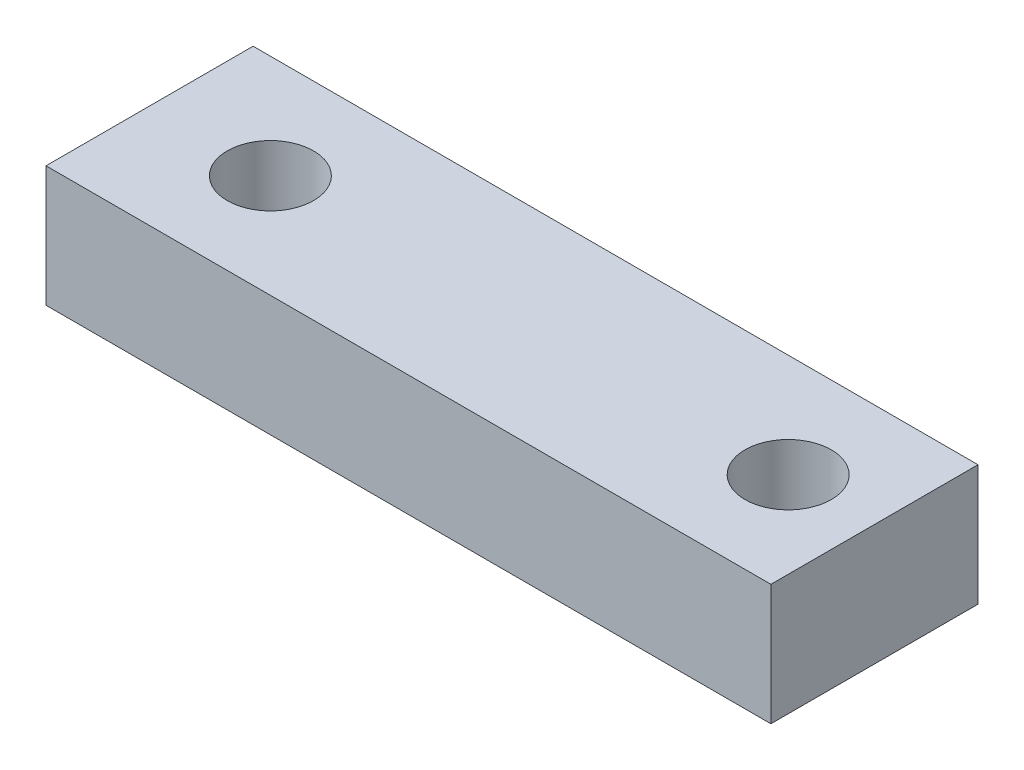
ISO-10303-21;
HEADER;
FILE_DESCRIPTION(('STEP AP214'),'2;1');
FILE_NAME('part.step','',(''),(''),'','','');
FILE_SCHEMA(('AUTOMOTIVE_DESIGN { 1 0 10303 214 1 1 1 1 }'));
ENDSEC;
DATA;
#1=APPLICATION_CONTEXT('core data for automotive mechanical design processes');
#2=APPLICATION_PROTOCOL_DEFINITION('international standard','automotive_design',2000,#1);
#3=PRODUCT_CONTEXT('',#1,'mechanical');
#4=PRODUCT('Part','Part','',(#3));
#5=PRODUCT_RELATED_PRODUCT_CATEGORY('part','',(#4));
#6=PRODUCT_DEFINITION_FORMATION('','',#4);
#7=PRODUCT_DEFINITION_CONTEXT('part definition',#1,'design');
#8=PRODUCT_DEFINITION('design','',#6,#7);
#9=PRODUCT_DEFINITION_SHAPE('','',#8);
#10=(LENGTH_UNIT() NAMED_UNIT(*) SI_UNIT(.MILLI.,.METRE.));
#11=(NAMED_UNIT(*) PLANE_ANGLE_UNIT() SI_UNIT($,.RADIAN.));
#12=(NAMED_UNIT(*) SI_UNIT($,.STERADIAN.) SOLID_ANGLE_UNIT());
#13=UNCERTAINTY_MEASURE_WITH_UNIT(LENGTH_MEASURE(1.E-05),#10,'distance_accuracy_value','');
#14=(GEOMETRIC_REPRESENTATION_CONTEXT(3) GLOBAL_UNCERTAINTY_ASSIGNED_CONTEXT((#13)) GLOBAL_UNIT_ASSIGNED_CONTEXT((#10,
#11,#12)) REPRESENTATION_CONTEXT('',''));
#15=CARTESIAN_POINT('',(0.,0.,0.));
#16=DIRECTION('',(0.,0.,1.));
#17=DIRECTION('',(1.,0.,0.));
#18=AXIS2_PLACEMENT_3D('',#15,#16,#17);
#19=CARTESIAN_POINT('',(0.,7.,-12.));
#20=DIRECTION('',(0.,-1.,0.));
#21=DIRECTION('',(0.,0.,-1.));
#22=AXIS2_PLACEMENT_3D('',#19,#20,#21);
#23=PLANE('',#22);
#24=CARTESIAN_POINT('',(37.,7.,-6.));
#25=DIRECTION('',(0.,1.,0.));
#26=DIRECTION('',(0.,0.,1.));
#27=AXIS2_PLACEMENT_3D('',#24,#25,#26);
#28=CIRCLE('',#27,2.5);
#29=CARTESIAN_POINT('',(37.,7.,-3.5));
#30=VERTEX_POINT('',#29);
#31=EDGE_CURVE('E85',#30,#30,#28,.T.);
#32=ORIENTED_EDGE('',*,*,#31,.F.);
#33=EDGE_LOOP('',(#32));
#34=FACE_BOUND('',#33,.T.);
#35=DIRECTION('',(0.,0.,1.));
#36=VECTOR('',#35,1.);
#37=CARTESIAN_POINT('',(0.,7.,0.));
#38=LINE('',#37,#36);
#39=CARTESIAN_POINT('',(0.,7.,-12.));
#40=VERTEX_POINT('',#39);
#41=CARTESIAN_POINT('',(0.,7.,0.));
#42=VERTEX_POINT('',#41);
#43=EDGE_CURVE('E95',#40,#42,#38,.T.);
#44=ORIENTED_EDGE('',*,*,#43,.T.);
#45=DIRECTION('',(1.,0.,0.));
#46=VECTOR('',#45,1.);
#47=CARTESIAN_POINT('',(0.,7.,0.));
#48=LINE('',#47,#46);
#49=CARTESIAN_POINT('',(42.,7.,0.));
#50=VERTEX_POINT('',#49);
#51=EDGE_CURVE('E80',#42,#50,#48,.T.);
#52=ORIENTED_EDGE('',*,*,#51,.T.);
#53=DIRECTION('',(0.,0.,-1.));
#54=VECTOR('',#53,1.);
#55=CARTESIAN_POINT('',(42.,7.,0.));
#56=LINE('',#55,#54);
#57=CARTESIAN_POINT('',(42.,7.,-12.));
#58=VERTEX_POINT('',#57);
#59=EDGE_CURVE('E46',#50,#58,#56,.T.);
#60=ORIENTED_EDGE('',*,*,#59,.T.);
#61=DIRECTION('',(-1.,0.,0.));
#62=VECTOR('',#61,1.);
#63=CARTESIAN_POINT('',(0.,7.,-12.));
#64=LINE('',#63,#62);
#65=EDGE_CURVE('E41',#58,#40,#64,.T.);
#66=ORIENTED_EDGE('',*,*,#65,.T.);
#67=EDGE_LOOP('',(#44,#52,#60,#66));
#68=FACE_BOUND('',#67,.T.);
#69=CARTESIAN_POINT('',(7.00000000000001,7.,-6.));
#70=DIRECTION('',(0.,1.,0.));
#71=DIRECTION('',(0.,0.,1.));
#72=AXIS2_PLACEMENT_3D('',#69,#70,#71);
#73=CIRCLE('',#72,2.5);
#74=CARTESIAN_POINT('',(7.00000000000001,7.,-3.5));
#75=VERTEX_POINT('',#74);
#76=EDGE_CURVE('E113',#75,#75,#73,.T.);
#77=ORIENTED_EDGE('',*,*,#76,.F.);
#78=EDGE_LOOP('',(#77));
#79=FACE_BOUND('',#78,.T.);
#80=ADVANCED_FACE('F26',(#34,#68,#79),#23,.F.);
#81=CARTESIAN_POINT('',(0.,0.,-12.));
#82=DIRECTION('',(0.,-1.,0.));
#83=DIRECTION('',(0.,0.,-1.));
#84=AXIS2_PLACEMENT_3D('',#81,#82,#83);
#85=PLANE('',#84);
#86=CARTESIAN_POINT('',(37.,0.,-6.));
#87=DIRECTION('',(0.,1.,0.));
#88=DIRECTION('',(0.,0.,1.));
#89=AXIS2_PLACEMENT_3D('',#86,#87,#88);
#90=CIRCLE('',#89,2.5);
#91=CARTESIAN_POINT('',(37.,0.,-3.5));
#92=VERTEX_POINT('',#91);
#93=EDGE_CURVE('E88',#92,#92,#90,.T.);
#94=ORIENTED_EDGE('',*,*,#93,.T.);
#95=EDGE_LOOP('',(#94));
#96=FACE_BOUND('',#95,.T.);
#97=DIRECTION('',(0.,0.,1.));
#98=VECTOR('',#97,1.);
#99=CARTESIAN_POINT('',(0.,0.,0.));
#100=LINE('',#99,#98);
#101=CARTESIAN_POINT('',(0.,0.,-12.));
#102=VERTEX_POINT('',#101);
#103=CARTESIAN_POINT('',(0.,0.,0.));
#104=VERTEX_POINT('',#103);
#105=EDGE_CURVE('E72',#102,#104,#100,.T.);
#106=ORIENTED_EDGE('',*,*,#105,.F.);
#107=DIRECTION('',(-1.,0.,0.));
#108=VECTOR('',#107,1.);
#109=CARTESIAN_POINT('',(0.,0.,-12.));
#110=LINE('',#109,#108);
#111=CARTESIAN_POINT('',(42.,0.,-12.));
#112=VERTEX_POINT('',#111);
#113=EDGE_CURVE('E93',#112,#102,#110,.T.);
#114=ORIENTED_EDGE('',*,*,#113,.F.);
#115=DIRECTION('',(0.,0.,-1.));
#116=VECTOR('',#115,1.);
#117=CARTESIAN_POINT('',(42.,0.,0.));
#118=LINE('',#117,#116);
#119=CARTESIAN_POINT('',(42.,0.,0.));
#120=VERTEX_POINT('',#119);
#121=EDGE_CURVE('E73',#120,#112,#118,.T.);
#122=ORIENTED_EDGE('',*,*,#121,.F.);
#123=DIRECTION('',(1.,0.,0.));
#124=VECTOR('',#123,1.);
#125=CARTESIAN_POINT('',(0.,0.,0.));
#126=LINE('',#125,#124);
#127=EDGE_CURVE('E67',#104,#120,#126,.T.);
#128=ORIENTED_EDGE('',*,*,#127,.F.);
#129=EDGE_LOOP('',(#106,#114,#122,#128));
#130=FACE_BOUND('',#129,.T.);
#131=CARTESIAN_POINT('',(7.00000000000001,0.,-6.));
#132=DIRECTION('',(0.,1.,0.));
#133=DIRECTION('',(0.,0.,1.));
#134=AXIS2_PLACEMENT_3D('',#131,#132,#133);
#135=CIRCLE('',#134,2.5);
#136=CARTESIAN_POINT('',(7.00000000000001,0.,-3.5));
#137=VERTEX_POINT('',#136);
#138=EDGE_CURVE('E115',#137,#137,#135,.T.);
#139=ORIENTED_EDGE('',*,*,#138,.T.);
#140=EDGE_LOOP('',(#139));
#141=FACE_BOUND('',#140,.T.);
#142=ADVANCED_FACE('F68',(#96,#130,#141),#85,.T.);
#143=CARTESIAN_POINT('',(0.,7.,0.));
#144=DIRECTION('',(1.,0.,0.));
#145=DIRECTION('',(0.,0.,-1.));
#146=AXIS2_PLACEMENT_3D('',#143,#144,#145);
#147=PLANE('',#146);
#148=ORIENTED_EDGE('',*,*,#105,.T.);
#149=DIRECTION('',(0.,-1.,0.));
#150=VECTOR('',#149,1.);
#151=CARTESIAN_POINT('',(0.,7.,0.));
#152=LINE('',#151,#150);
#153=EDGE_CURVE('E11',#42,#104,#152,.T.);
#154=ORIENTED_EDGE('',*,*,#153,.F.);
#155=ORIENTED_EDGE('',*,*,#43,.F.);
#156=DIRECTION('',(0.,-1.,0.));
#157=VECTOR('',#156,1.);
#158=CARTESIAN_POINT('',(0.,7.,-12.));
#159=LINE('',#158,#157);
#160=EDGE_CURVE('E84',#40,#102,#159,.T.);
#161=ORIENTED_EDGE('',*,*,#160,.T.);
#162=EDGE_LOOP('',(#148,#154,#155,#161));
#163=FACE_BOUND('',#162,.T.);
#164=ADVANCED_FACE('F28',(#163),#147,.F.);
#165=CARTESIAN_POINT('',(0.,7.,0.));
#166=DIRECTION('',(0.,0.,-1.));
#167=DIRECTION('',(-1.,0.,0.));
#168=AXIS2_PLACEMENT_3D('',#165,#166,#167);
#169=PLANE('',#168);
#170=ORIENTED_EDGE('',*,*,#127,.T.);
#171=DIRECTION('',(0.,-1.,0.));
#172=VECTOR('',#171,1.);
#173=CARTESIAN_POINT('',(42.,7.,0.));
#174=LINE('',#173,#172);
#175=EDGE_CURVE('E34',#50,#120,#174,.T.);
#176=ORIENTED_EDGE('',*,*,#175,.F.);
#177=ORIENTED_EDGE('',*,*,#51,.F.);
#178=ORIENTED_EDGE('',*,*,#153,.T.);
#179=EDGE_LOOP('',(#170,#176,#177,#178));
#180=FACE_BOUND('',#179,.T.);
#181=ADVANCED_FACE('F79',(#180),#169,.F.);
#182=CARTESIAN_POINT('',(42.,7.,0.));
#183=DIRECTION('',(-1.,0.,0.));
#184=DIRECTION('',(0.,0.,1.));
#185=AXIS2_PLACEMENT_3D('',#182,#183,#184);
#186=PLANE('',#185);
#187=ORIENTED_EDGE('',*,*,#121,.T.);
#188=DIRECTION('',(0.,-1.,0.));
#189=VECTOR('',#188,1.);
#190=CARTESIAN_POINT('',(42.,7.,-12.));
#191=LINE('',#190,#189);
#192=EDGE_CURVE('E101',#58,#112,#191,.T.);
#193=ORIENTED_EDGE('',*,*,#192,.F.);
#194=ORIENTED_EDGE('',*,*,#59,.F.);
#195=ORIENTED_EDGE('',*,*,#175,.T.);
#196=EDGE_LOOP('',(#187,#193,#194,#195));
#197=FACE_BOUND('',#196,.T.);
#198=ADVANCED_FACE('F104',(#197),#186,.F.);
#199=CARTESIAN_POINT('',(0.,7.,-12.));
#200=DIRECTION('',(0.,0.,1.));
#201=DIRECTION('',(1.,0.,0.));
#202=AXIS2_PLACEMENT_3D('',#199,#200,#201);
#203=PLANE('',#202);
#204=ORIENTED_EDGE('',*,*,#113,.T.);
#205=ORIENTED_EDGE('',*,*,#160,.F.);
#206=ORIENTED_EDGE('',*,*,#65,.F.);
#207=ORIENTED_EDGE('',*,*,#192,.T.);
#208=EDGE_LOOP('',(#204,#205,#206,#207));
#209=FACE_BOUND('',#208,.T.);
#210=ADVANCED_FACE('F106',(#209),#203,.F.);
#211=CARTESIAN_POINT('',(37.,7.,-6.));
#212=DIRECTION('',(0.,-1.,0.));
#213=DIRECTION('',(0.,0.,-1.));
#214=AXIS2_PLACEMENT_3D('',#211,#212,#213);
#215=CYLINDRICAL_SURFACE('',#214,2.5);
#216=ORIENTED_EDGE('',*,*,#31,.T.);
#217=EDGE_LOOP('',(#216));
#218=FACE_BOUND('',#217,.T.);
#219=ORIENTED_EDGE('',*,*,#93,.F.);
#220=EDGE_LOOP('',(#219));
#221=FACE_BOUND('',#220,.T.);
#222=ADVANCED_FACE('F124',(#218,#221),#215,.F.);
#223=CARTESIAN_POINT('',(7.00000000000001,7.,-6.));
#224=DIRECTION('',(0.,-1.,0.));
#225=DIRECTION('',(0.,0.,-1.));
#226=AXIS2_PLACEMENT_3D('',#223,#224,#225);
#227=CYLINDRICAL_SURFACE('',#226,2.5);
#228=ORIENTED_EDGE('',*,*,#76,.T.);
#229=EDGE_LOOP('',(#228));
#230=FACE_BOUND('',#229,.T.);
#231=ORIENTED_EDGE('',*,*,#138,.F.);
#232=EDGE_LOOP('',(#231));
#233=FACE_BOUND('',#232,.T.);
#234=ADVANCED_FACE('F122',(#230,#233),#227,.F.);
#235=CLOSED_SHELL('',(#80,#142,#164,#181,#198,#210,#222,#234));
#236=MANIFOLD_SOLID_BREP('B2',#235);
#237=ADVANCED_BREP_SHAPE_REPRESENTATION('',(#18,#236),#14);
#238=SHAPE_DEFINITION_REPRESENTATION(#9,#237);
ENDSEC;
END-ISO-10303-21;
